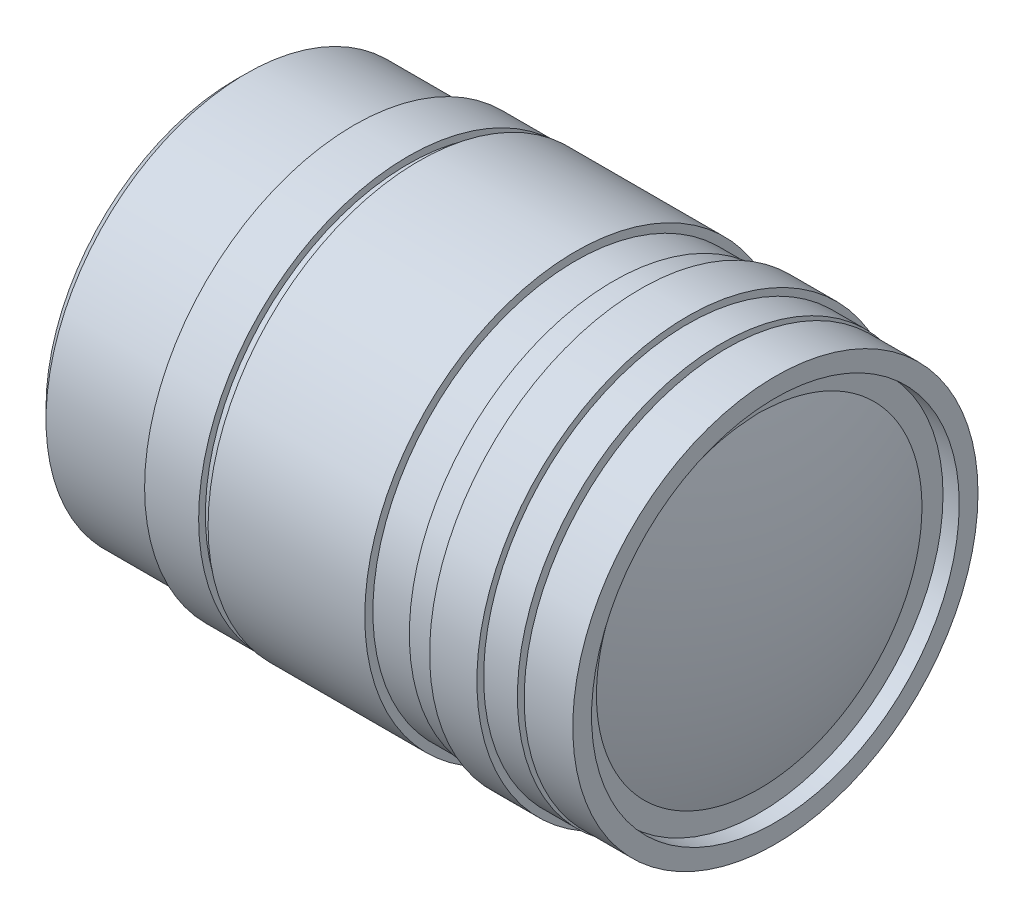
from build123d import *

# Parameters (mm, degrees)
SKETCH1_R           = 37
BOSS_EXTRUDE1_DEPTH = 22
SKETCH2_R           = 38.75
BOSS_EXTRUDE2_DEPTH = 10
SKETCH3_R           = 37.5
BOSS_EXTRUDE3_DEPTH = 38
BOSS_EXTRUDE4_START = 34
SKETCH4_R           = 39
BOSS_EXTRUDE4_DEPTH = 29
BOSS_EXTRUDE6_START = 70
SKETCH7_R           = 37.75
BOSS_EXTRUDE6_DEPTH = 20
BOSS_EXTRUDE5_START = 75
SKETCH5_R           = 39
BOSS_EXTRUDE5_DEPTH = 8.75
SKETCH8_R           = 35
BOSS_EXTRUDE7_DEPTH = 3
BOSS_EXTRUDE8_START = 91
SKETCH10_R          = 37.5
BOSS_EXTRUDE8_DEPTH = 9
CHAMFER1_SIZE       = 2
SKETCH11_R          = 34.026825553
CUT_EXTRUDE1_DEPTH  = 3


with BuildPart() as part:
    # Sketch1 → Boss-Extrude1 (new body)
    with BuildSketch(Plane(origin=(0, 0, 0), x_dir=(0, 0, -1), z_dir=(1, 0, 0))):
        Circle(SKETCH1_R)
    extrude(amount=BOSS_EXTRUDE1_DEPTH)

    # Sketch2 → Boss-Extrude2 (add)
    with BuildSketch(Plane(origin=(22, 0, 0), x_dir=(0, 0, -1), z_dir=(1, 0, 0))):
        Circle(SKETCH2_R)
    extrude(amount=BOSS_EXTRUDE2_DEPTH)

    # Sketch3 → Boss-Extrude3 (add)
    with BuildSketch(Plane(origin=(32, 0, 0), x_dir=(0, 0, -1), z_dir=(1, 0, 0))):
        Circle(SKETCH3_R)
    extrude(amount=BOSS_EXTRUDE3_DEPTH)

    # Sketch7 → Boss-Extrude6 (add)
    with BuildSketch(Plane(origin=(0, 0, 0), x_dir=(0, 0, -1), z_dir=(1, 0, 0)).offset(BOSS_EXTRUDE6_START)):
        Circle(SKETCH7_R)
    extrude(amount=BOSS_EXTRUDE6_DEPTH)

    # Sketch8 → Boss-Extrude7 (add)
    with BuildSketch(Plane(origin=(90, 0, 0), x_dir=(0, 0, -1), z_dir=(1, 0, 0))):
        Circle(SKETCH8_R)
    extrude(amount=BOSS_EXTRUDE7_DEPTH)

    # Sketch10 → Boss-Extrude8 (add)
    with BuildSketch(Plane(origin=(0, 0, 0), x_dir=(0, 0, -1), z_dir=(1, 0, 0)).offset(BOSS_EXTRUDE8_START)):
        Circle(SKETCH10_R)
    extrude(amount=BOSS_EXTRUDE8_DEPTH)

    # Chamfer1
    chamfer1_edges = [part.edges().sort_by_distance(p)[0] for p in [
        (0, 0, 37),
    ]]
    chamfer(chamfer1_edges, length=CHAMFER1_SIZE)

    # Sketch11 → Cut-Extrude1 (cut)
    with BuildSketch(Plane(origin=(100, 0, 0), x_dir=(0, 0, -1), z_dir=(1, 0, 0))):
        Circle(SKETCH11_R)
    extrude(amount=-CUT_EXTRUDE1_DEPTH, mode=Mode.SUBTRACT)


with BuildPart() as body_2:
    # Sketch4 → Boss-Extrude4 (new body)
    with BuildSketch(Plane(origin=(0, 0, 0), x_dir=(0, 0, -1), z_dir=(1, 0, 0)).offset(BOSS_EXTRUDE4_START)):
        with Locations(Location((0, 0, 0), (0, 0, 180))):
            Circle(SKETCH4_R)
    extrude(amount=BOSS_EXTRUDE4_DEPTH)


with BuildPart() as body_3:
    # Sketch5 → Boss-Extrude5 (new body)
    with BuildSketch(Plane(origin=(0, 0, 0), x_dir=(0, 0, -1), z_dir=(1, 0, 0)).offset(BOSS_EXTRUDE5_START)):
        Circle(SKETCH5_R)
    extrude(amount=BOSS_EXTRUDE5_DEPTH)


with BuildPart() as body_4:
    # Sketch12 → Revolve2 (revolve)
    with BuildSketch(Plane.XY):
        with BuildLine():
            Line((95.022451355, 35.922168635), (92.361549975, 35.922168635))
            Line((92.361549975, 35.922168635), (92.361549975, 0.495430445))
            Line((92.361549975, 0.495430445), (101.584307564, 0.544901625))
            ThreePointArc((101.584307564, 0.544901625), (99.882141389, 18.526367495), (95.022451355, 35.922168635))
        make_face()
    revolve(axis=Axis((0, 0, 0), (0.999985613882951, 0.005363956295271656, 0)))


solid = Compound([part.part, body_2.part, body_3.part, body_4.part])
